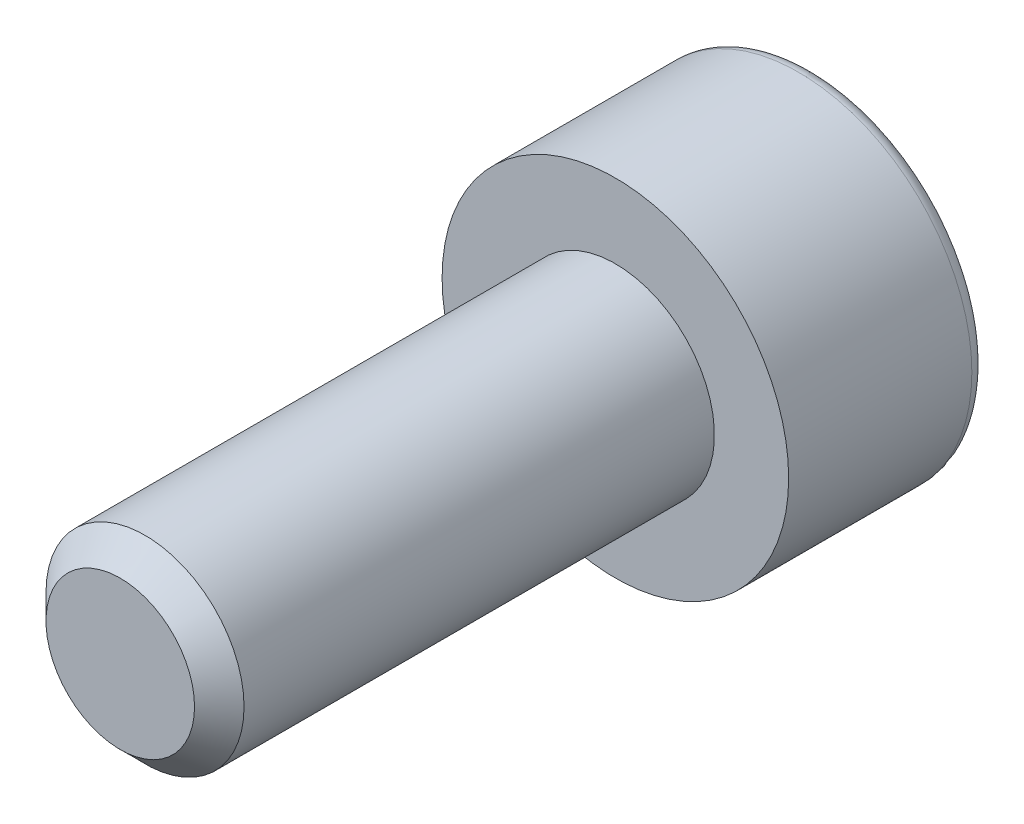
ISO-10303-21;
HEADER;
FILE_DESCRIPTION(('STEP AP214'),'2;1');
FILE_NAME('part.step','',(''),(''),'','','');
FILE_SCHEMA(('AUTOMOTIVE_DESIGN { 1 0 10303 214 1 1 1 1 }'));
ENDSEC;
DATA;
#1=APPLICATION_CONTEXT('core data for automotive mechanical design processes');
#2=APPLICATION_PROTOCOL_DEFINITION('international standard','automotive_design',2000,#1);
#3=PRODUCT_CONTEXT('',#1,'mechanical');
#4=PRODUCT('Part','Part','',(#3));
#5=PRODUCT_RELATED_PRODUCT_CATEGORY('part','',(#4));
#6=PRODUCT_DEFINITION_FORMATION('','',#4);
#7=PRODUCT_DEFINITION_CONTEXT('part definition',#1,'design');
#8=PRODUCT_DEFINITION('design','',#6,#7);
#9=PRODUCT_DEFINITION_SHAPE('','',#8);
#10=(LENGTH_UNIT() NAMED_UNIT(*) SI_UNIT(.MILLI.,.METRE.));
#11=(NAMED_UNIT(*) PLANE_ANGLE_UNIT() SI_UNIT($,.RADIAN.));
#12=(NAMED_UNIT(*) SI_UNIT($,.STERADIAN.) SOLID_ANGLE_UNIT());
#13=UNCERTAINTY_MEASURE_WITH_UNIT(LENGTH_MEASURE(1.E-05),#10,'distance_accuracy_value','');
#14=(GEOMETRIC_REPRESENTATION_CONTEXT(3) GLOBAL_UNCERTAINTY_ASSIGNED_CONTEXT((#13)) GLOBAL_UNIT_ASSIGNED_CONTEXT((#10,
#11,#12)) REPRESENTATION_CONTEXT('',''));
#15=CARTESIAN_POINT('',(0.,0.,0.));
#16=DIRECTION('',(0.,0.,1.));
#17=DIRECTION('',(1.,0.,0.));
#18=AXIS2_PLACEMENT_3D('',#15,#16,#17);
#19=CARTESIAN_POINT('',(0.,0.,10.));
#20=DIRECTION('',(0.,0.,-1.));
#21=DIRECTION('',(-1.,0.,0.));
#22=AXIS2_PLACEMENT_3D('',#19,#20,#21);
#23=CYLINDRICAL_SURFACE('',#22,2.);
#24=CARTESIAN_POINT('',(0.,0.,9.5));
#25=DIRECTION('',(0.,0.,1.));
#26=DIRECTION('',(1.,0.,0.));
#27=AXIS2_PLACEMENT_3D('',#24,#25,#26);
#28=CIRCLE('',#27,2.);
#29=CARTESIAN_POINT('',(2.,0.,9.5));
#30=VERTEX_POINT('',#29);
#31=EDGE_CURVE('E150',#30,#30,#28,.F.);
#32=ORIENTED_EDGE('',*,*,#31,.T.);
#33=EDGE_LOOP('',(#32));
#34=FACE_BOUND('',#33,.T.);
#35=CARTESIAN_POINT('',(0.,0.,0.));
#36=DIRECTION('',(0.,0.,-1.));
#37=DIRECTION('',(-1.,0.,0.));
#38=AXIS2_PLACEMENT_3D('',#35,#36,#37);
#39=CIRCLE('',#38,2.);
#40=CARTESIAN_POINT('',(-2.,0.,0.));
#41=VERTEX_POINT('',#40);
#42=EDGE_CURVE('E144',#41,#41,#39,.T.);
#43=ORIENTED_EDGE('',*,*,#42,.F.);
#44=EDGE_LOOP('',(#43));
#45=FACE_BOUND('',#44,.T.);
#46=ADVANCED_FACE('F34',(#34,#45),#23,.T.);
#47=CARTESIAN_POINT('',(0.,0.,10.));
#48=DIRECTION('',(0.,0.,1.));
#49=DIRECTION('',(1.,0.,0.));
#50=AXIS2_PLACEMENT_3D('',#47,#48,#49);
#51=PLANE('',#50);
#52=CARTESIAN_POINT('',(0.,0.,10.));
#53=DIRECTION('',(0.,0.,1.));
#54=DIRECTION('',(1.,0.,0.));
#55=AXIS2_PLACEMENT_3D('',#52,#53,#54);
#56=CIRCLE('',#55,1.5);
#57=CARTESIAN_POINT('',(1.5,0.,10.));
#58=VERTEX_POINT('',#57);
#59=EDGE_CURVE('E147',#58,#58,#56,.T.);
#60=ORIENTED_EDGE('',*,*,#59,.T.);
#61=EDGE_LOOP('',(#60));
#62=FACE_BOUND('',#61,.T.);
#63=ADVANCED_FACE('F171',(#62),#51,.T.);
#64=CARTESIAN_POINT('',(0.,0.,10.));
#65=DIRECTION('',(0.,0.,-1.));
#66=DIRECTION('',(-1.,0.,0.));
#67=AXIS2_PLACEMENT_3D('',#64,#65,#66);
#68=CONICAL_SURFACE('',#67,1.5,0.785398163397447);
#69=ORIENTED_EDGE('',*,*,#31,.F.);
#70=EDGE_LOOP('',(#69));
#71=FACE_BOUND('',#70,.T.);
#72=ORIENTED_EDGE('',*,*,#59,.F.);
#73=EDGE_LOOP('',(#72));
#74=FACE_BOUND('',#73,.T.);
#75=ADVANCED_FACE('F177',(#71,#74),#68,.T.);
#76=CARTESIAN_POINT('',(0.,0.,0.));
#77=DIRECTION('',(0.,0.,-1.));
#78=DIRECTION('',(-1.,0.,0.));
#79=AXIS2_PLACEMENT_3D('',#76,#77,#78);
#80=PLANE('',#79);
#81=CARTESIAN_POINT('',(0.,0.,0.));
#82=DIRECTION('',(0.,0.,-1.));
#83=DIRECTION('',(-1.,0.,0.));
#84=AXIS2_PLACEMENT_3D('',#81,#82,#83);
#85=CIRCLE('',#84,3.5);
#86=CARTESIAN_POINT('',(-3.5,0.,0.));
#87=VERTEX_POINT('',#86);
#88=EDGE_CURVE('E136',#87,#87,#85,.T.);
#89=ORIENTED_EDGE('',*,*,#88,.F.);
#90=EDGE_LOOP('',(#89));
#91=FACE_BOUND('',#90,.T.);
#92=ORIENTED_EDGE('',*,*,#42,.T.);
#93=EDGE_LOOP('',(#92));
#94=FACE_BOUND('',#93,.T.);
#95=ADVANCED_FACE('F183',(#91,#94),#80,.F.);
#96=CARTESIAN_POINT('',(0.,0.,-4.));
#97=DIRECTION('',(0.,0.,1.));
#98=DIRECTION('',(1.,0.,0.));
#99=AXIS2_PLACEMENT_3D('',#96,#97,#98);
#100=CYLINDRICAL_SURFACE('',#99,3.5);
#101=CARTESIAN_POINT('',(0.,0.,-3.7));
#102=DIRECTION('',(0.,0.,-1.));
#103=DIRECTION('',(-1.,0.,0.));
#104=AXIS2_PLACEMENT_3D('',#101,#102,#103);
#105=CIRCLE('',#104,3.5);
#106=CARTESIAN_POINT('',(-3.5,0.,-3.7));
#107=VERTEX_POINT('',#106);
#108=EDGE_CURVE('E11',#107,#107,#105,.F.);
#109=ORIENTED_EDGE('',*,*,#108,.T.);
#110=EDGE_LOOP('',(#109));
#111=FACE_BOUND('',#110,.T.);
#112=ORIENTED_EDGE('',*,*,#88,.T.);
#113=EDGE_LOOP('',(#112));
#114=FACE_BOUND('',#113,.T.);
#115=ADVANCED_FACE('F166',(#111,#114),#100,.T.);
#116=CARTESIAN_POINT('',(0.,0.,-4.));
#117=DIRECTION('',(0.,0.,-1.));
#118=DIRECTION('',(-1.,0.,0.));
#119=AXIS2_PLACEMENT_3D('',#116,#117,#118);
#120=PLANE('',#119);
#121=DIRECTION('',(0.866025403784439,0.5,0.));
#122=VECTOR('',#121,1.);
#123=CARTESIAN_POINT('',(-1.5,0.86602540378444,-4.));
#124=LINE('',#123,#122);
#125=CARTESIAN_POINT('',(-1.5,0.86602540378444,-4.));
#126=VERTEX_POINT('',#125);
#127=CARTESIAN_POINT('',(0.,1.73205080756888,-4.));
#128=VERTEX_POINT('',#127);
#129=EDGE_CURVE('E49',#126,#128,#124,.T.);
#130=ORIENTED_EDGE('',*,*,#129,.F.);
#131=DIRECTION('',(0.,1.,0.));
#132=VECTOR('',#131,1.);
#133=CARTESIAN_POINT('',(-1.5,-0.86602540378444,-4.));
#134=LINE('',#133,#132);
#135=CARTESIAN_POINT('',(-1.5,-0.86602540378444,-4.));
#136=VERTEX_POINT('',#135);
#137=EDGE_CURVE('E132',#136,#126,#134,.T.);
#138=ORIENTED_EDGE('',*,*,#137,.F.);
#139=DIRECTION('',(-0.866025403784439,0.5,0.));
#140=VECTOR('',#139,1.);
#141=CARTESIAN_POINT('',(0.,-1.73205080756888,-4.));
#142=LINE('',#141,#140);
#143=CARTESIAN_POINT('',(0.,-1.73205080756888,-4.));
#144=VERTEX_POINT('',#143);
#145=EDGE_CURVE('E130',#144,#136,#142,.T.);
#146=ORIENTED_EDGE('',*,*,#145,.F.);
#147=DIRECTION('',(-0.866025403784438,-0.5,0.));
#148=VECTOR('',#147,1.);
#149=CARTESIAN_POINT('',(1.5,-0.866025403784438,-4.));
#150=LINE('',#149,#148);
#151=CARTESIAN_POINT('',(1.5,-0.866025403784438,-4.));
#152=VERTEX_POINT('',#151);
#153=EDGE_CURVE('E97',#152,#144,#150,.T.);
#154=ORIENTED_EDGE('',*,*,#153,.F.);
#155=DIRECTION('',(0.,-1.,0.));
#156=VECTOR('',#155,1.);
#157=CARTESIAN_POINT('',(1.5,0.866025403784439,-4.));
#158=LINE('',#157,#156);
#159=CARTESIAN_POINT('',(1.5,0.866025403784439,-4.));
#160=VERTEX_POINT('',#159);
#161=EDGE_CURVE('E126',#160,#152,#158,.T.);
#162=ORIENTED_EDGE('',*,*,#161,.F.);
#163=DIRECTION('',(0.866025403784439,-0.5,0.));
#164=VECTOR('',#163,1.);
#165=CARTESIAN_POINT('',(0.,1.73205080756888,-4.));
#166=LINE('',#165,#164);
#167=EDGE_CURVE('E123',#128,#160,#166,.T.);
#168=ORIENTED_EDGE('',*,*,#167,.F.);
#169=EDGE_LOOP('',(#130,#138,#146,#154,#162,#168));
#170=FACE_BOUND('',#169,.T.);
#171=CARTESIAN_POINT('',(0.,0.,-4.));
#172=DIRECTION('',(0.,0.,-1.));
#173=DIRECTION('',(-1.,0.,0.));
#174=AXIS2_PLACEMENT_3D('',#171,#172,#173);
#175=CIRCLE('',#174,3.2);
#176=CARTESIAN_POINT('',(-3.2,0.,-4.));
#177=VERTEX_POINT('',#176);
#178=EDGE_CURVE('E42',#177,#177,#175,.T.);
#179=ORIENTED_EDGE('',*,*,#178,.T.);
#180=EDGE_LOOP('',(#179));
#181=FACE_BOUND('',#180,.T.);
#182=ADVANCED_FACE('F155',(#170,#181),#120,.T.);
#183=CARTESIAN_POINT('',(0.,0.,-3.7));
#184=DIRECTION('',(0.,0.,-1.));
#185=DIRECTION('',(-1.,0.,0.));
#186=AXIS2_PLACEMENT_3D('',#183,#184,#185);
#187=TOROIDAL_SURFACE('',#186,3.2,0.3);
#188=ORIENTED_EDGE('',*,*,#108,.F.);
#189=EDGE_LOOP('',(#188));
#190=FACE_BOUND('',#189,.T.);
#191=ORIENTED_EDGE('',*,*,#178,.F.);
#192=EDGE_LOOP('',(#191));
#193=FACE_BOUND('',#192,.T.);
#194=ADVANCED_FACE('F36',(#190,#193),#187,.T.);
#195=CARTESIAN_POINT('',(-1.5,0.86602540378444,0.));
#196=DIRECTION('',(-0.5,0.866025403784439,0.));
#197=DIRECTION('',(-0.866025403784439,-0.5,0.));
#198=AXIS2_PLACEMENT_3D('',#195,#196,#197);
#199=PLANE('',#198);
#200=ORIENTED_EDGE('',*,*,#129,.T.);
#201=DIRECTION('',(0.,0.,-1.));
#202=VECTOR('',#201,1.);
#203=CARTESIAN_POINT('',(0.,1.73205080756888,0.));
#204=LINE('',#203,#202);
#205=CARTESIAN_POINT('',(0.,1.73205080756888,0.));
#206=VERTEX_POINT('',#205);
#207=EDGE_CURVE('E79',#206,#128,#204,.T.);
#208=ORIENTED_EDGE('',*,*,#207,.F.);
#209=DIRECTION('',(0.866025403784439,0.5,0.));
#210=VECTOR('',#209,1.);
#211=CARTESIAN_POINT('',(-1.5,0.86602540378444,0.));
#212=LINE('',#211,#210);
#213=CARTESIAN_POINT('',(-1.5,0.86602540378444,0.));
#214=VERTEX_POINT('',#213);
#215=EDGE_CURVE('E134',#214,#206,#212,.T.);
#216=ORIENTED_EDGE('',*,*,#215,.F.);
#217=DIRECTION('',(0.,0.,-1.));
#218=VECTOR('',#217,1.);
#219=CARTESIAN_POINT('',(-1.5,0.86602540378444,0.));
#220=LINE('',#219,#218);
#221=EDGE_CURVE('E57',#214,#126,#220,.T.);
#222=ORIENTED_EDGE('',*,*,#221,.T.);
#223=EDGE_LOOP('',(#200,#208,#216,#222));
#224=FACE_BOUND('',#223,.T.);
#225=ADVANCED_FACE('F158',(#224),#199,.F.);
#226=CARTESIAN_POINT('',(-1.5,-0.86602540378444,0.));
#227=DIRECTION('',(-1.,0.,0.));
#228=DIRECTION('',(0.,-1.,0.));
#229=AXIS2_PLACEMENT_3D('',#226,#227,#228);
#230=PLANE('',#229);
#231=ORIENTED_EDGE('',*,*,#137,.T.);
#232=ORIENTED_EDGE('',*,*,#221,.F.);
#233=DIRECTION('',(0.,1.,0.));
#234=VECTOR('',#233,1.);
#235=CARTESIAN_POINT('',(-1.5,-0.86602540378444,0.));
#236=LINE('',#235,#234);
#237=CARTESIAN_POINT('',(-1.5,-0.86602540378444,0.));
#238=VERTEX_POINT('',#237);
#239=EDGE_CURVE('E109',#238,#214,#236,.T.);
#240=ORIENTED_EDGE('',*,*,#239,.F.);
#241=DIRECTION('',(0.,0.,-1.));
#242=VECTOR('',#241,1.);
#243=CARTESIAN_POINT('',(-1.5,-0.86602540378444,0.));
#244=LINE('',#243,#242);
#245=EDGE_CURVE('E101',#238,#136,#244,.T.);
#246=ORIENTED_EDGE('',*,*,#245,.T.);
#247=EDGE_LOOP('',(#231,#232,#240,#246));
#248=FACE_BOUND('',#247,.T.);
#249=ADVANCED_FACE('F164',(#248),#230,.F.);
#250=CARTESIAN_POINT('',(0.,-1.73205080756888,0.));
#251=DIRECTION('',(-0.5,-0.866025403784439,0.));
#252=DIRECTION('',(0.866025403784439,-0.5,0.));
#253=AXIS2_PLACEMENT_3D('',#250,#251,#252);
#254=PLANE('',#253);
#255=ORIENTED_EDGE('',*,*,#145,.T.);
#256=ORIENTED_EDGE('',*,*,#245,.F.);
#257=DIRECTION('',(-0.866025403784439,0.5,0.));
#258=VECTOR('',#257,1.);
#259=CARTESIAN_POINT('',(0.,-1.73205080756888,0.));
#260=LINE('',#259,#258);
#261=CARTESIAN_POINT('',(0.,-1.73205080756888,0.));
#262=VERTEX_POINT('',#261);
#263=EDGE_CURVE('E105',#262,#238,#260,.T.);
#264=ORIENTED_EDGE('',*,*,#263,.F.);
#265=DIRECTION('',(0.,0.,-1.));
#266=VECTOR('',#265,1.);
#267=CARTESIAN_POINT('',(0.,-1.73205080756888,0.));
#268=LINE('',#267,#266);
#269=EDGE_CURVE('E90',#262,#144,#268,.T.);
#270=ORIENTED_EDGE('',*,*,#269,.T.);
#271=EDGE_LOOP('',(#255,#256,#264,#270));
#272=FACE_BOUND('',#271,.T.);
#273=ADVANCED_FACE('F106',(#272),#254,.F.);
#274=CARTESIAN_POINT('',(1.5,-0.866025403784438,0.));
#275=DIRECTION('',(0.5,-0.866025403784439,0.));
#276=DIRECTION('',(0.866025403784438,0.5,0.));
#277=AXIS2_PLACEMENT_3D('',#274,#275,#276);
#278=PLANE('',#277);
#279=ORIENTED_EDGE('',*,*,#153,.T.);
#280=ORIENTED_EDGE('',*,*,#269,.F.);
#281=DIRECTION('',(-0.866025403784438,-0.5,0.));
#282=VECTOR('',#281,1.);
#283=CARTESIAN_POINT('',(1.5,-0.866025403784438,0.));
#284=LINE('',#283,#282);
#285=CARTESIAN_POINT('',(1.5,-0.866025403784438,0.));
#286=VERTEX_POINT('',#285);
#287=EDGE_CURVE('E94',#286,#262,#284,.T.);
#288=ORIENTED_EDGE('',*,*,#287,.F.);
#289=DIRECTION('',(0.,0.,-1.));
#290=VECTOR('',#289,1.);
#291=CARTESIAN_POINT('',(1.5,-0.866025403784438,0.));
#292=LINE('',#291,#290);
#293=EDGE_CURVE('E102',#286,#152,#292,.T.);
#294=ORIENTED_EDGE('',*,*,#293,.T.);
#295=EDGE_LOOP('',(#279,#280,#288,#294));
#296=FACE_BOUND('',#295,.T.);
#297=ADVANCED_FACE('F92',(#296),#278,.F.);
#298=CARTESIAN_POINT('',(1.5,0.866025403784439,0.));
#299=DIRECTION('',(1.,0.,0.));
#300=DIRECTION('',(0.,0.,-1.));
#301=AXIS2_PLACEMENT_3D('',#298,#299,#300);
#302=PLANE('',#301);
#303=ORIENTED_EDGE('',*,*,#161,.T.);
#304=ORIENTED_EDGE('',*,*,#293,.F.);
#305=DIRECTION('',(0.,-1.,0.));
#306=VECTOR('',#305,1.);
#307=CARTESIAN_POINT('',(1.5,0.866025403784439,0.));
#308=LINE('',#307,#306);
#309=CARTESIAN_POINT('',(1.5,0.866025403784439,0.));
#310=VERTEX_POINT('',#309);
#311=EDGE_CURVE('E115',#310,#286,#308,.T.);
#312=ORIENTED_EDGE('',*,*,#311,.F.);
#313=DIRECTION('',(0.,0.,-1.));
#314=VECTOR('',#313,1.);
#315=CARTESIAN_POINT('',(1.5,0.866025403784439,0.));
#316=LINE('',#315,#314);
#317=EDGE_CURVE('E139',#310,#160,#316,.T.);
#318=ORIENTED_EDGE('',*,*,#317,.T.);
#319=EDGE_LOOP('',(#303,#304,#312,#318));
#320=FACE_BOUND('',#319,.T.);
#321=ADVANCED_FACE('F203',(#320),#302,.F.);
#322=CARTESIAN_POINT('',(0.,1.73205080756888,0.));
#323=DIRECTION('',(0.5,0.866025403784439,0.));
#324=DIRECTION('',(-0.866025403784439,0.5,0.));
#325=AXIS2_PLACEMENT_3D('',#322,#323,#324);
#326=PLANE('',#325);
#327=ORIENTED_EDGE('',*,*,#167,.T.);
#328=ORIENTED_EDGE('',*,*,#317,.F.);
#329=DIRECTION('',(0.866025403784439,-0.5,0.));
#330=VECTOR('',#329,1.);
#331=CARTESIAN_POINT('',(0.,1.73205080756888,0.));
#332=LINE('',#331,#330);
#333=EDGE_CURVE('E117',#206,#310,#332,.T.);
#334=ORIENTED_EDGE('',*,*,#333,.F.);
#335=ORIENTED_EDGE('',*,*,#207,.T.);
#336=EDGE_LOOP('',(#327,#328,#334,#335));
#337=FACE_BOUND('',#336,.T.);
#338=ADVANCED_FACE('F200',(#337),#326,.F.);
#339=CARTESIAN_POINT('',(1.5,2.59807621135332,0.));
#340=DIRECTION('',(0.,0.,-1.));
#341=DIRECTION('',(-1.,0.,0.));
#342=AXIS2_PLACEMENT_3D('',#339,#340,#341);
#343=PLANE('',#342);
#344=ORIENTED_EDGE('',*,*,#215,.T.);
#345=ORIENTED_EDGE('',*,*,#333,.T.);
#346=ORIENTED_EDGE('',*,*,#311,.T.);
#347=ORIENTED_EDGE('',*,*,#287,.T.);
#348=ORIENTED_EDGE('',*,*,#263,.T.);
#349=ORIENTED_EDGE('',*,*,#239,.T.);
#350=EDGE_LOOP('',(#344,#345,#346,#347,#348,#349));
#351=FACE_BOUND('',#350,.T.);
#352=ADVANCED_FACE('F112',(#351),#343,.T.);
#353=CLOSED_SHELL('',(#46,#63,#75,#95,#115,#182,#194,#225,#249,#273,#297,#321,#338,#352));
#354=MANIFOLD_SOLID_BREP('B2',#353);
#355=ADVANCED_BREP_SHAPE_REPRESENTATION('',(#18,#354),#14);
#356=SHAPE_DEFINITION_REPRESENTATION(#9,#355);
ENDSEC;
END-ISO-10303-21;
